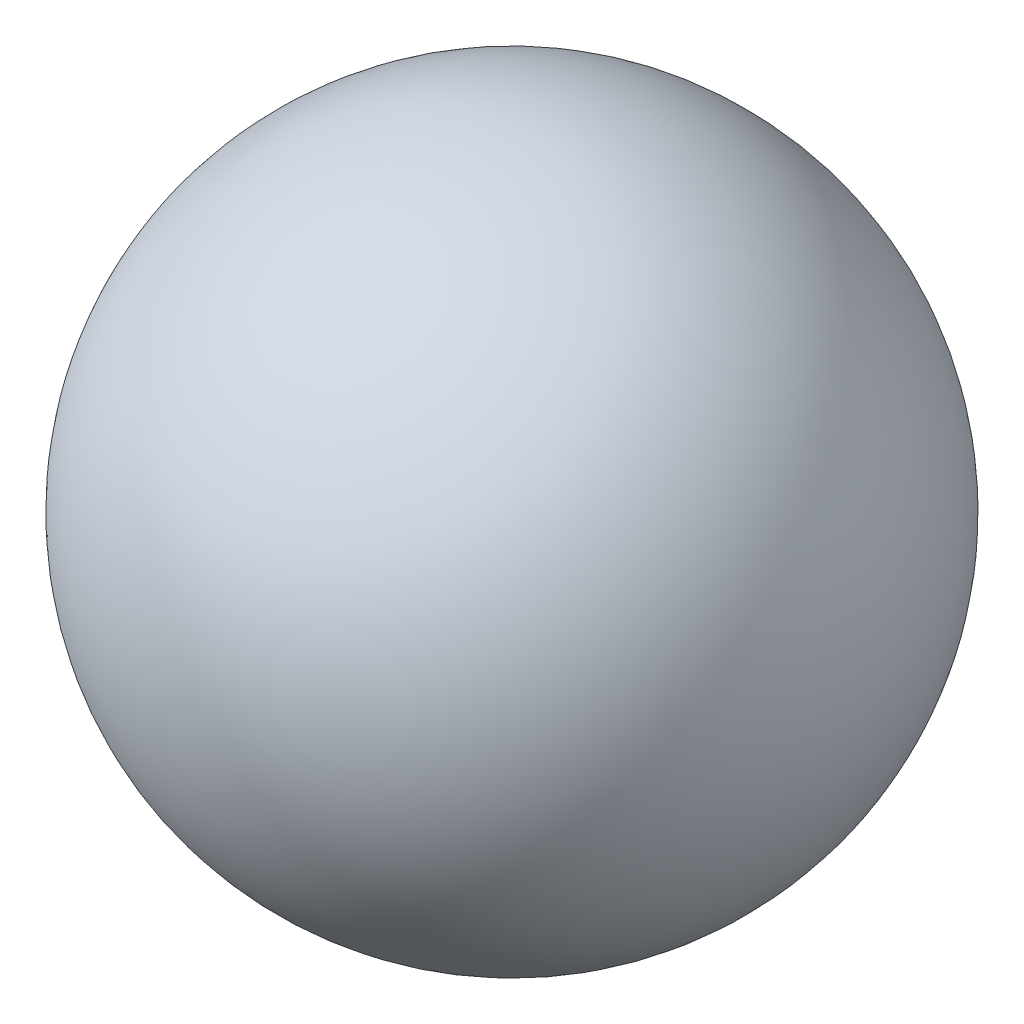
from build123d import *


with BuildPart() as part:
    # Sketch 1 → Revolve 1 (revolve)
    with BuildSketch(Plane.XY):
        with BuildLine():
            Line((-8.5, 0), (8.5, 0))
            ThreePointArc((8.5, 0), (0, 8.5), (-8.5, 0))
        make_face()
    revolve(axis=Axis((-8.5, 0, 0), (1, 0, 0)))


solid = part.part
